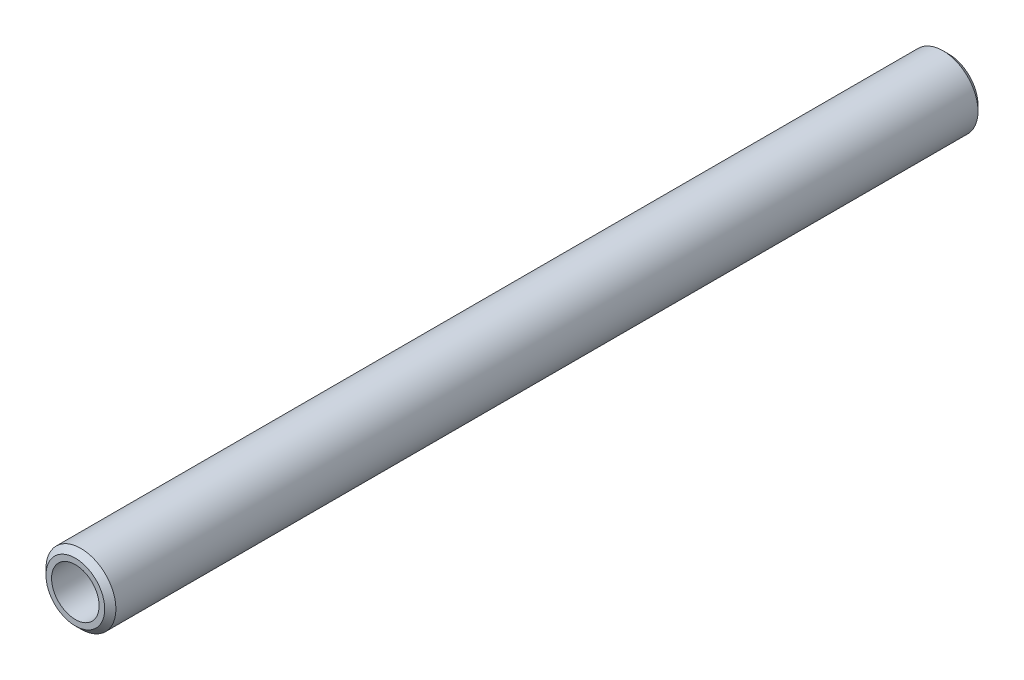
ISO-10303-21;
HEADER;
FILE_DESCRIPTION(('STEP AP214'),'2;1');
FILE_NAME('part.step','',(''),(''),'','','');
FILE_SCHEMA(('AUTOMOTIVE_DESIGN { 1 0 10303 214 1 1 1 1 }'));
ENDSEC;
DATA;
#1=APPLICATION_CONTEXT('core data for automotive mechanical design processes');
#2=APPLICATION_PROTOCOL_DEFINITION('international standard','automotive_design',2000,#1);
#3=PRODUCT_CONTEXT('',#1,'mechanical');
#4=PRODUCT('Part','Part','',(#3));
#5=PRODUCT_RELATED_PRODUCT_CATEGORY('part','',(#4));
#6=PRODUCT_DEFINITION_FORMATION('','',#4);
#7=PRODUCT_DEFINITION_CONTEXT('part definition',#1,'design');
#8=PRODUCT_DEFINITION('design','',#6,#7);
#9=PRODUCT_DEFINITION_SHAPE('','',#8);
#10=(LENGTH_UNIT() NAMED_UNIT(*) SI_UNIT(.MILLI.,.METRE.));
#11=(NAMED_UNIT(*) PLANE_ANGLE_UNIT() SI_UNIT($,.RADIAN.));
#12=(NAMED_UNIT(*) SI_UNIT($,.STERADIAN.) SOLID_ANGLE_UNIT());
#13=UNCERTAINTY_MEASURE_WITH_UNIT(LENGTH_MEASURE(1.E-05),#10,'distance_accuracy_value','');
#14=(GEOMETRIC_REPRESENTATION_CONTEXT(3) GLOBAL_UNCERTAINTY_ASSIGNED_CONTEXT((#13)) GLOBAL_UNIT_ASSIGNED_CONTEXT((#10,
#11,#12)) REPRESENTATION_CONTEXT('',''));
#15=CARTESIAN_POINT('',(0.,0.,0.));
#16=DIRECTION('',(0.,0.,1.));
#17=DIRECTION('',(1.,0.,0.));
#18=AXIS2_PLACEMENT_3D('',#15,#16,#17);
#19=CARTESIAN_POINT('',(0.,0.,156.));
#20=DIRECTION('',(0.,0.,1.));
#21=DIRECTION('',(1.,0.,0.));
#22=AXIS2_PLACEMENT_3D('',#19,#20,#21);
#23=PLANE('',#22);
#24=CARTESIAN_POINT('',(0.,0.,156.));
#25=DIRECTION('',(0.,0.,1.));
#26=DIRECTION('',(1.,0.,0.));
#27=AXIS2_PLACEMENT_3D('',#24,#25,#26);
#28=CIRCLE('',#27,10.5);
#29=CARTESIAN_POINT('',(10.5,0.,156.));
#30=VERTEX_POINT('',#29);
#31=EDGE_CURVE('E10',#30,#30,#28,.T.);
#32=ORIENTED_EDGE('',*,*,#31,.T.);
#33=EDGE_LOOP('',(#32));
#34=FACE_BOUND('',#33,.T.);
#35=CARTESIAN_POINT('',(0.,0.,156.));
#36=DIRECTION('',(0.,0.,1.));
#37=DIRECTION('',(1.,0.,0.));
#38=AXIS2_PLACEMENT_3D('',#35,#36,#37);
#39=CIRCLE('',#38,8.5);
#40=CARTESIAN_POINT('',(8.5,0.,156.));
#41=VERTEX_POINT('',#40);
#42=EDGE_CURVE('E52',#41,#41,#39,.T.);
#43=ORIENTED_EDGE('',*,*,#42,.F.);
#44=EDGE_LOOP('',(#43));
#45=FACE_BOUND('',#44,.T.);
#46=ADVANCED_FACE('F32',(#34,#45),#23,.T.);
#47=CARTESIAN_POINT('',(0.,0.,-156.));
#48=DIRECTION('',(0.,0.,1.));
#49=DIRECTION('',(1.,0.,0.));
#50=AXIS2_PLACEMENT_3D('',#47,#48,#49);
#51=PLANE('',#50);
#52=CARTESIAN_POINT('',(0.,0.,-156.));
#53=DIRECTION('',(0.,0.,1.));
#54=DIRECTION('',(1.,0.,0.));
#55=AXIS2_PLACEMENT_3D('',#52,#53,#54);
#56=CIRCLE('',#55,10.5);
#57=CARTESIAN_POINT('',(10.5,0.,-156.));
#58=VERTEX_POINT('',#57);
#59=EDGE_CURVE('E39',#58,#58,#56,.F.);
#60=ORIENTED_EDGE('',*,*,#59,.T.);
#61=EDGE_LOOP('',(#60));
#62=FACE_BOUND('',#61,.T.);
#63=CARTESIAN_POINT('',(0.,0.,-156.));
#64=DIRECTION('',(0.,0.,1.));
#65=DIRECTION('',(1.,0.,0.));
#66=AXIS2_PLACEMENT_3D('',#63,#64,#65);
#67=CIRCLE('',#66,8.5);
#68=CARTESIAN_POINT('',(8.5,0.,-156.));
#69=VERTEX_POINT('',#68);
#70=EDGE_CURVE('E53',#69,#69,#67,.T.);
#71=ORIENTED_EDGE('',*,*,#70,.T.);
#72=EDGE_LOOP('',(#71));
#73=FACE_BOUND('',#72,.T.);
#74=ADVANCED_FACE('F63',(#62,#73),#51,.F.);
#75=CARTESIAN_POINT('',(0.,0.,156.));
#76=DIRECTION('',(0.,0.,-1.));
#77=DIRECTION('',(-1.,0.,0.));
#78=AXIS2_PLACEMENT_3D('',#75,#76,#77);
#79=CYLINDRICAL_SURFACE('',#78,12.5);
#80=CARTESIAN_POINT('',(0.,0.,-154.));
#81=DIRECTION('',(0.,0.,1.));
#82=DIRECTION('',(1.,0.,0.));
#83=AXIS2_PLACEMENT_3D('',#80,#81,#82);
#84=CIRCLE('',#83,12.5);
#85=CARTESIAN_POINT('',(12.5,0.,-154.));
#86=VERTEX_POINT('',#85);
#87=EDGE_CURVE('E43',#86,#86,#84,.T.);
#88=ORIENTED_EDGE('',*,*,#87,.T.);
#89=EDGE_LOOP('',(#88));
#90=FACE_BOUND('',#89,.T.);
#91=CARTESIAN_POINT('',(0.,0.,154.));
#92=DIRECTION('',(0.,0.,1.));
#93=DIRECTION('',(1.,0.,0.));
#94=AXIS2_PLACEMENT_3D('',#91,#92,#93);
#95=CIRCLE('',#94,12.5);
#96=CARTESIAN_POINT('',(12.5,0.,154.));
#97=VERTEX_POINT('',#96);
#98=EDGE_CURVE('E47',#97,#97,#95,.F.);
#99=ORIENTED_EDGE('',*,*,#98,.T.);
#100=EDGE_LOOP('',(#99));
#101=FACE_BOUND('',#100,.T.);
#102=ADVANCED_FACE('F68',(#90,#101),#79,.T.);
#103=CARTESIAN_POINT('',(0.,0.,156.));
#104=DIRECTION('',(0.,0.,-1.));
#105=DIRECTION('',(-1.,0.,0.));
#106=AXIS2_PLACEMENT_3D('',#103,#104,#105);
#107=CYLINDRICAL_SURFACE('',#106,8.5);
#108=ORIENTED_EDGE('',*,*,#42,.T.);
#109=EDGE_LOOP('',(#108));
#110=FACE_BOUND('',#109,.T.);
#111=ORIENTED_EDGE('',*,*,#70,.F.);
#112=EDGE_LOOP('',(#111));
#113=FACE_BOUND('',#112,.T.);
#114=ADVANCED_FACE('F59',(#110,#113),#107,.F.);
#115=CARTESIAN_POINT('',(0.,0.,-154.));
#116=DIRECTION('',(0.,0.,1.));
#117=DIRECTION('',(1.,0.,0.));
#118=AXIS2_PLACEMENT_3D('',#115,#116,#117);
#119=CONICAL_SURFACE('',#118,12.5,0.785398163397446);
#120=ORIENTED_EDGE('',*,*,#59,.F.);
#121=EDGE_LOOP('',(#120));
#122=FACE_BOUND('',#121,.T.);
#123=ORIENTED_EDGE('',*,*,#87,.F.);
#124=EDGE_LOOP('',(#123));
#125=FACE_BOUND('',#124,.T.);
#126=ADVANCED_FACE('F74',(#122,#125),#119,.T.);
#127=CARTESIAN_POINT('',(0.,0.,156.));
#128=DIRECTION('',(0.,0.,-1.));
#129=DIRECTION('',(-1.,0.,0.));
#130=AXIS2_PLACEMENT_3D('',#127,#128,#129);
#131=CONICAL_SURFACE('',#130,10.5,0.785398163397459);
#132=ORIENTED_EDGE('',*,*,#98,.F.);
#133=EDGE_LOOP('',(#132));
#134=FACE_BOUND('',#133,.T.);
#135=ORIENTED_EDGE('',*,*,#31,.F.);
#136=EDGE_LOOP('',(#135));
#137=FACE_BOUND('',#136,.T.);
#138=ADVANCED_FACE('F34',(#134,#137),#131,.T.);
#139=CLOSED_SHELL('',(#46,#74,#102,#114,#126,#138));
#140=MANIFOLD_SOLID_BREP('B2',#139);
#141=ADVANCED_BREP_SHAPE_REPRESENTATION('',(#18,#140),#14);
#142=SHAPE_DEFINITION_REPRESENTATION(#9,#141);
ENDSEC;
END-ISO-10303-21;
